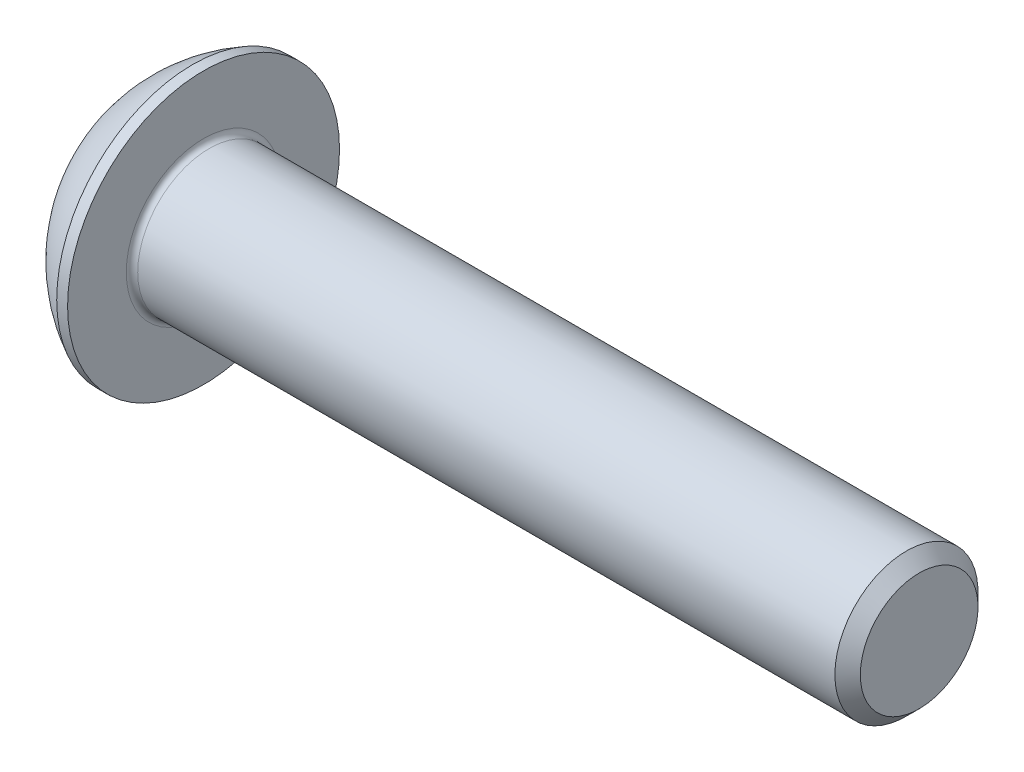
from build123d import *

# Parameters (mm, degrees)
FILLET1_R   = 0.2
HEX_2_DEPTH = 1.56


with BuildPart() as part:
    # BodySke → BaseBody (revolve)
    with BuildSketch(Plane.XY, mode=Mode.PRIVATE) as basebody_sk:
        with BuildLine():
            Line((27.75, 0), (27.75, 2.055))
            Line((27.75, 2.055), (27.305, 2.5))
            Line((27.305, 2.5), (2.75, 2.5))
            Line((2.75, 2.5), (2.75, 4.75))
            Line((2.75, 4.75), (2.37, 4.75))
            ThreePointArc((2.37, 4.75), (0.992680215, 3.754414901), (0, 2.375))
            Line((0, 2.375), (0, 0))
            Line((0, 0), (27.75, 0))
        make_face()
    revolve(basebody_sk.sketch.rotate(Axis((0, 0, 0), (1, 0, 0)), 90), axis=Axis((0, 0, 0), (1, 0, 0)))

    # Fillet1
    fillet1_edges = [part.edges().sort_by_distance(p)[0] for p in [
        (2.75, 0, -2.5),
    ]]
    fillet(fillet1_edges, radius=FILLET1_R)

    # Sketch2 → PreBroach (revolve, cut)
    with BuildSketch(Plane.XY, mode=Mode.PRIVATE) as prebroach_sk:
        Polygon((0, 1.5), (1.56, 1.5), (2.426025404, 0), (0, 0), align=None)
    revolve(prebroach_sk.sketch.rotate(Axis((0, 0, 0), (1, 0, 0)), 90), axis=Axis((0, 0, 0), (1, 0, 0)), mode=Mode.SUBTRACT)

    # Sketch3 → Hex 2 (cut)
    with BuildSketch(Plane(origin=(0, 0, 0), x_dir=(0, 0, -1), z_dir=(1, 0, 0))):
        Polygon((-1.5, -0.866025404), (-1.5, 0.866025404), (0, 1.732050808), (1.5, 0.866025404), (1.5, -0.866025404), (0, -1.732050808), align=None)
    extrude(amount=HEX_2_DEPTH, mode=Mode.SUBTRACT)


solid = part.part
